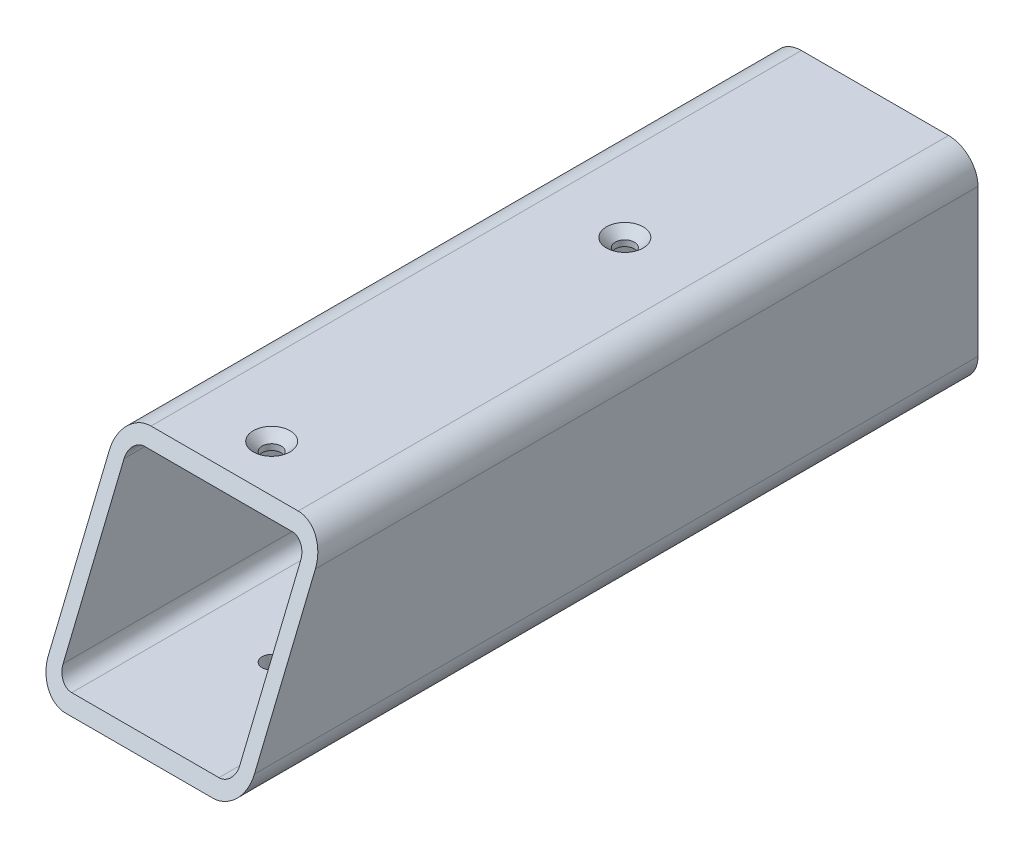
ISO-10303-21;
HEADER;
FILE_DESCRIPTION(('STEP AP214'),'2;1');
FILE_NAME('part.step','',(''),(''),'','','');
FILE_SCHEMA(('AUTOMOTIVE_DESIGN { 1 0 10303 214 1 1 1 1 }'));
ENDSEC;
DATA;
#1=APPLICATION_CONTEXT('core data for automotive mechanical design processes');
#2=APPLICATION_PROTOCOL_DEFINITION('international standard','automotive_design',2000,#1);
#3=PRODUCT_CONTEXT('',#1,'mechanical');
#4=PRODUCT('Part','Part','',(#3));
#5=PRODUCT_RELATED_PRODUCT_CATEGORY('part','',(#4));
#6=PRODUCT_DEFINITION_FORMATION('','',#4);
#7=PRODUCT_DEFINITION_CONTEXT('part definition',#1,'design');
#8=PRODUCT_DEFINITION('design','',#6,#7);
#9=PRODUCT_DEFINITION_SHAPE('','',#8);
#10=(LENGTH_UNIT() NAMED_UNIT(*) SI_UNIT(.MILLI.,.METRE.));
#11=(NAMED_UNIT(*) PLANE_ANGLE_UNIT() SI_UNIT($,.RADIAN.));
#12=(NAMED_UNIT(*) SI_UNIT($,.STERADIAN.) SOLID_ANGLE_UNIT());
#13=UNCERTAINTY_MEASURE_WITH_UNIT(LENGTH_MEASURE(1.E-05),#10,'distance_accuracy_value','');
#14=(GEOMETRIC_REPRESENTATION_CONTEXT(3) GLOBAL_UNCERTAINTY_ASSIGNED_CONTEXT((#13)) GLOBAL_UNIT_ASSIGNED_CONTEXT((#10,
#11,#12)) REPRESENTATION_CONTEXT('',''));
#15=CARTESIAN_POINT('',(0.,0.,0.));
#16=DIRECTION('',(0.,0.,1.));
#17=DIRECTION('',(1.,0.,0.));
#18=AXIS2_PLACEMENT_3D('',#15,#16,#17);
#19=CARTESIAN_POINT('',(-25.,-25.,0.));
#20=DIRECTION('',(0.,0.,-1.));
#21=DIRECTION('',(-1.,0.,0.));
#22=AXIS2_PLACEMENT_3D('',#19,#20,#21);
#23=PLANE('',#22);
#24=CARTESIAN_POINT('',(-25.,-25.,0.));
#25=DIRECTION('',(0.,0.,1.));
#26=DIRECTION('',(-1.,0.,0.));
#27=AXIS2_PLACEMENT_3D('',#24,#25,#26);
#28=CIRCLE('',#27,10.);
#29=CARTESIAN_POINT('',(-35.,-25.,0.));
#30=VERTEX_POINT('',#29);
#31=CARTESIAN_POINT('',(-25.,-35.,0.));
#32=VERTEX_POINT('',#31);
#33=EDGE_CURVE('E339',#30,#32,#28,.T.);
#34=ORIENTED_EDGE('',*,*,#33,.F.);
#35=DIRECTION('',(0.,-1.,0.));
#36=VECTOR('',#35,1.);
#37=CARTESIAN_POINT('',(-35.,25.,0.));
#38=LINE('',#37,#36);
#39=CARTESIAN_POINT('',(-35.,25.,0.));
#40=VERTEX_POINT('',#39);
#41=EDGE_CURVE('E158',#40,#30,#38,.T.);
#42=ORIENTED_EDGE('',*,*,#41,.F.);
#43=CARTESIAN_POINT('',(-25.,25.,0.));
#44=DIRECTION('',(0.,0.,1.));
#45=DIRECTION('',(1.,0.,0.));
#46=AXIS2_PLACEMENT_3D('',#43,#44,#45);
#47=CIRCLE('',#46,9.99999999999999);
#48=CARTESIAN_POINT('',(-25.,35.,0.));
#49=VERTEX_POINT('',#48);
#50=EDGE_CURVE('E355',#49,#40,#47,.T.);
#51=ORIENTED_EDGE('',*,*,#50,.F.);
#52=DIRECTION('',(-1.,0.,0.));
#53=VECTOR('',#52,1.);
#54=CARTESIAN_POINT('',(-25.,35.,0.));
#55=LINE('',#54,#53);
#56=CARTESIAN_POINT('',(25.,35.,0.));
#57=VERTEX_POINT('',#56);
#58=EDGE_CURVE('E352',#57,#49,#55,.T.);
#59=ORIENTED_EDGE('',*,*,#58,.F.);
#60=CARTESIAN_POINT('',(25.,25.,0.));
#61=DIRECTION('',(0.,0.,1.));
#62=DIRECTION('',(1.,0.,0.));
#63=AXIS2_PLACEMENT_3D('',#60,#61,#62);
#64=CIRCLE('',#63,10.);
#65=CARTESIAN_POINT('',(35.,25.,0.));
#66=VERTEX_POINT('',#65);
#67=EDGE_CURVE('E349',#66,#57,#64,.T.);
#68=ORIENTED_EDGE('',*,*,#67,.F.);
#69=DIRECTION('',(0.,1.,0.));
#70=VECTOR('',#69,1.);
#71=CARTESIAN_POINT('',(35.,25.,0.));
#72=LINE('',#71,#70);
#73=CARTESIAN_POINT('',(35.,-25.,0.));
#74=VERTEX_POINT('',#73);
#75=EDGE_CURVE('E346',#74,#66,#72,.T.);
#76=ORIENTED_EDGE('',*,*,#75,.F.);
#77=CARTESIAN_POINT('',(25.,-25.,0.));
#78=DIRECTION('',(0.,0.,1.));
#79=DIRECTION('',(-1.,0.,0.));
#80=AXIS2_PLACEMENT_3D('',#77,#78,#79);
#81=CIRCLE('',#80,10.);
#82=CARTESIAN_POINT('',(25.,-35.,0.));
#83=VERTEX_POINT('',#82);
#84=EDGE_CURVE('E344',#83,#74,#81,.T.);
#85=ORIENTED_EDGE('',*,*,#84,.F.);
#86=DIRECTION('',(1.,0.,0.));
#87=VECTOR('',#86,1.);
#88=CARTESIAN_POINT('',(-25.,-35.,0.));
#89=LINE('',#88,#87);
#90=EDGE_CURVE('E171',#32,#83,#89,.T.);
#91=ORIENTED_EDGE('',*,*,#90,.F.);
#92=EDGE_LOOP('',(#34,#42,#51,#59,#68,#76,#85,#91));
#93=FACE_BOUND('',#92,.T.);
#94=DIRECTION('',(-1.,0.,0.));
#95=VECTOR('',#94,1.);
#96=CARTESIAN_POINT('',(-25.,30.,0.));
#97=LINE('',#96,#95);
#98=CARTESIAN_POINT('',(25.,30.,0.));
#99=VERTEX_POINT('',#98);
#100=CARTESIAN_POINT('',(-25.,30.,0.));
#101=VERTEX_POINT('',#100);
#102=EDGE_CURVE('E286',#99,#101,#97,.T.);
#103=ORIENTED_EDGE('',*,*,#102,.T.);
#104=CARTESIAN_POINT('',(-25.,25.,0.));
#105=DIRECTION('',(0.,0.,1.));
#106=DIRECTION('',(1.,0.,0.));
#107=AXIS2_PLACEMENT_3D('',#104,#105,#106);
#108=CIRCLE('',#107,5.);
#109=CARTESIAN_POINT('',(-30.,25.,0.));
#110=VERTEX_POINT('',#109);
#111=EDGE_CURVE('E284',#101,#110,#108,.T.);
#112=ORIENTED_EDGE('',*,*,#111,.T.);
#113=DIRECTION('',(0.,-1.,0.));
#114=VECTOR('',#113,1.);
#115=CARTESIAN_POINT('',(-30.,25.,0.));
#116=LINE('',#115,#114);
#117=CARTESIAN_POINT('',(-30.,-25.,0.));
#118=VERTEX_POINT('',#117);
#119=EDGE_CURVE('E308',#110,#118,#116,.T.);
#120=ORIENTED_EDGE('',*,*,#119,.T.);
#121=CARTESIAN_POINT('',(-25.,-25.,0.));
#122=DIRECTION('',(0.,0.,1.));
#123=DIRECTION('',(-1.,0.,0.));
#124=AXIS2_PLACEMENT_3D('',#121,#122,#123);
#125=CIRCLE('',#124,5.);
#126=CARTESIAN_POINT('',(-25.,-30.,0.));
#127=VERTEX_POINT('',#126);
#128=EDGE_CURVE('E311',#118,#127,#125,.T.);
#129=ORIENTED_EDGE('',*,*,#128,.T.);
#130=DIRECTION('',(1.,0.,0.));
#131=VECTOR('',#130,1.);
#132=CARTESIAN_POINT('',(-25.,-30.,0.));
#133=LINE('',#132,#131);
#134=CARTESIAN_POINT('',(25.,-30.,0.));
#135=VERTEX_POINT('',#134);
#136=EDGE_CURVE('E314',#127,#135,#133,.T.);
#137=ORIENTED_EDGE('',*,*,#136,.T.);
#138=CARTESIAN_POINT('',(25.,-25.,0.));
#139=DIRECTION('',(0.,0.,1.));
#140=DIRECTION('',(-1.,0.,0.));
#141=AXIS2_PLACEMENT_3D('',#138,#139,#140);
#142=CIRCLE('',#141,4.99999999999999);
#143=CARTESIAN_POINT('',(30.,-25.,0.));
#144=VERTEX_POINT('',#143);
#145=EDGE_CURVE('E317',#135,#144,#142,.T.);
#146=ORIENTED_EDGE('',*,*,#145,.T.);
#147=DIRECTION('',(0.,1.,0.));
#148=VECTOR('',#147,1.);
#149=CARTESIAN_POINT('',(30.,25.,0.));
#150=LINE('',#149,#148);
#151=CARTESIAN_POINT('',(30.,25.,0.));
#152=VERTEX_POINT('',#151);
#153=EDGE_CURVE('E320',#144,#152,#150,.T.);
#154=ORIENTED_EDGE('',*,*,#153,.T.);
#155=CARTESIAN_POINT('',(25.,25.,0.));
#156=DIRECTION('',(0.,0.,1.));
#157=DIRECTION('',(1.,0.,0.));
#158=AXIS2_PLACEMENT_3D('',#155,#156,#157);
#159=CIRCLE('',#158,5.);
#160=EDGE_CURVE('E323',#152,#99,#159,.T.);
#161=ORIENTED_EDGE('',*,*,#160,.T.);
#162=EDGE_LOOP('',(#103,#112,#120,#129,#137,#146,#154,#161));
#163=FACE_BOUND('',#162,.T.);
#164=ADVANCED_FACE('F34',(#93,#163),#23,.T.);
#165=CARTESIAN_POINT('',(-25.,-25.,250.));
#166=DIRECTION('',(0.,0.,-1.));
#167=DIRECTION('',(-1.,0.,0.));
#168=AXIS2_PLACEMENT_3D('',#165,#166,#167);
#169=CYLINDRICAL_SURFACE('',#168,10.);
#170=DIRECTION('',(0.,0.,-1.));
#171=VECTOR('',#170,1.);
#172=CARTESIAN_POINT('',(-25.,-35.,250.));
#173=LINE('',#172,#171);
#174=CARTESIAN_POINT('',(-25.,-35.,250.));
#175=VERTEX_POINT('',#174);
#176=EDGE_CURVE('E172',#175,#32,#173,.T.);
#177=ORIENTED_EDGE('',*,*,#176,.F.);
#178=CARTESIAN_POINT('',(-25.,-25.,245.857864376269));
#179=DIRECTION('',(0.,-0.382683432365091,-0.923879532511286));
#180=DIRECTION('',(0.,0.923879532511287,-0.382683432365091));
#181=AXIS2_PLACEMENT_3D('',#178,#179,#180);
#182=ELLIPSE('',#181,10.8239220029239,10.);
#183=CARTESIAN_POINT('',(-35.,-25.,245.857864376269));
#184=VERTEX_POINT('',#183);
#185=EDGE_CURVE('E152',#175,#184,#182,.T.);
#186=ORIENTED_EDGE('',*,*,#185,.T.);
#187=DIRECTION('',(0.,0.,-1.));
#188=VECTOR('',#187,1.);
#189=CARTESIAN_POINT('',(-35.,-25.,250.));
#190=LINE('',#189,#188);
#191=EDGE_CURVE('E157',#184,#30,#190,.T.);
#192=ORIENTED_EDGE('',*,*,#191,.T.);
#193=ORIENTED_EDGE('',*,*,#33,.T.);
#194=EDGE_LOOP('',(#177,#186,#192,#193));
#195=FACE_BOUND('',#194,.T.);
#196=ADVANCED_FACE('F213',(#195),#169,.T.);
#197=CARTESIAN_POINT('',(-25.,-35.,250.));
#198=DIRECTION('',(0.,1.,0.));
#199=DIRECTION('',(-1.,0.,0.));
#200=AXIS2_PLACEMENT_3D('',#197,#198,#199);
#201=PLANE('',#200);
#202=CARTESIAN_POINT('',(0.,-35.,205.));
#203=DIRECTION('',(0.,1.,0.));
#204=DIRECTION('',(-1.,0.,0.));
#205=AXIS2_PLACEMENT_3D('',#202,#203,#204);
#206=CIRCLE('',#205,3.25);
#207=CARTESIAN_POINT('',(-3.25,-35.,205.));
#208=VERTEX_POINT('',#207);
#209=EDGE_CURVE('E196',#208,#208,#206,.F.);
#210=ORIENTED_EDGE('',*,*,#209,.F.);
#211=EDGE_LOOP('',(#210));
#212=FACE_BOUND('',#211,.T.);
#213=CARTESIAN_POINT('',(0.,-35.,85.));
#214=DIRECTION('',(0.,1.,0.));
#215=DIRECTION('',(-1.,0.,0.));
#216=AXIS2_PLACEMENT_3D('',#213,#214,#215);
#217=CIRCLE('',#216,3.25);
#218=CARTESIAN_POINT('',(-3.25,-35.,85.));
#219=VERTEX_POINT('',#218);
#220=EDGE_CURVE('E187',#219,#219,#217,.F.);
#221=ORIENTED_EDGE('',*,*,#220,.F.);
#222=EDGE_LOOP('',(#221));
#223=FACE_BOUND('',#222,.T.);
#224=ORIENTED_EDGE('',*,*,#90,.T.);
#225=DIRECTION('',(0.,0.,-1.));
#226=VECTOR('',#225,1.);
#227=CARTESIAN_POINT('',(25.,-35.,250.));
#228=LINE('',#227,#226);
#229=CARTESIAN_POINT('',(25.,-35.,250.));
#230=VERTEX_POINT('',#229);
#231=EDGE_CURVE('E165',#230,#83,#228,.T.);
#232=ORIENTED_EDGE('',*,*,#231,.F.);
#233=DIRECTION('',(1.,0.,0.));
#234=VECTOR('',#233,1.);
#235=CARTESIAN_POINT('',(-25.,-35.,250.));
#236=LINE('',#235,#234);
#237=EDGE_CURVE('E146',#175,#230,#236,.T.);
#238=ORIENTED_EDGE('',*,*,#237,.F.);
#239=ORIENTED_EDGE('',*,*,#176,.T.);
#240=EDGE_LOOP('',(#224,#232,#238,#239));
#241=FACE_BOUND('',#240,.T.);
#242=ADVANCED_FACE('F170',(#212,#223,#241),#201,.F.);
#243=CARTESIAN_POINT('',(25.,-25.,250.));
#244=DIRECTION('',(0.,0.,-1.));
#245=DIRECTION('',(-1.,0.,0.));
#246=AXIS2_PLACEMENT_3D('',#243,#244,#245);
#247=CYLINDRICAL_SURFACE('',#246,10.);
#248=DIRECTION('',(0.,0.,-1.));
#249=VECTOR('',#248,1.);
#250=CARTESIAN_POINT('',(35.,-25.,250.));
#251=LINE('',#250,#249);
#252=CARTESIAN_POINT('',(35.,-25.,245.857864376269));
#253=VERTEX_POINT('',#252);
#254=EDGE_CURVE('E167',#253,#74,#251,.T.);
#255=ORIENTED_EDGE('',*,*,#254,.F.);
#256=CARTESIAN_POINT('',(25.,-25.,245.857864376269));
#257=DIRECTION('',(0.,-0.382683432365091,-0.923879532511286));
#258=DIRECTION('',(0.,0.923879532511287,-0.382683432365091));
#259=AXIS2_PLACEMENT_3D('',#256,#257,#258);
#260=ELLIPSE('',#259,10.8239220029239,10.);
#261=EDGE_CURVE('E149',#253,#230,#260,.T.);
#262=ORIENTED_EDGE('',*,*,#261,.T.);
#263=ORIENTED_EDGE('',*,*,#231,.T.);
#264=ORIENTED_EDGE('',*,*,#84,.T.);
#265=EDGE_LOOP('',(#255,#262,#263,#264));
#266=FACE_BOUND('',#265,.T.);
#267=ADVANCED_FACE('F163',(#266),#247,.T.);
#268=CARTESIAN_POINT('',(35.,25.,250.));
#269=DIRECTION('',(-1.,0.,0.));
#270=DIRECTION('',(0.,-1.,0.));
#271=AXIS2_PLACEMENT_3D('',#268,#269,#270);
#272=PLANE('',#271);
#273=DIRECTION('',(0.,0.,-1.));
#274=VECTOR('',#273,1.);
#275=CARTESIAN_POINT('',(35.,25.,250.));
#276=LINE('',#275,#274);
#277=CARTESIAN_POINT('',(35.,25.,225.147186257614));
#278=VERTEX_POINT('',#277);
#279=EDGE_CURVE('E176',#278,#66,#276,.T.);
#280=ORIENTED_EDGE('',*,*,#279,.F.);
#281=DIRECTION('',(0.,-0.923879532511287,0.382683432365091));
#282=VECTOR('',#281,1.);
#283=CARTESIAN_POINT('',(35.,16.2132034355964,228.786796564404));
#284=LINE('',#283,#282);
#285=EDGE_CURVE('E168',#278,#253,#284,.T.);
#286=ORIENTED_EDGE('',*,*,#285,.T.);
#287=ORIENTED_EDGE('',*,*,#254,.T.);
#288=ORIENTED_EDGE('',*,*,#75,.T.);
#289=EDGE_LOOP('',(#280,#286,#287,#288));
#290=FACE_BOUND('',#289,.T.);
#291=ADVANCED_FACE('F242',(#290),#272,.F.);
#292=CARTESIAN_POINT('',(25.,25.,250.));
#293=DIRECTION('',(0.,0.,-1.));
#294=DIRECTION('',(-1.,0.,0.));
#295=AXIS2_PLACEMENT_3D('',#292,#293,#294);
#296=CYLINDRICAL_SURFACE('',#295,10.);
#297=DIRECTION('',(0.,0.,-1.));
#298=VECTOR('',#297,1.);
#299=CARTESIAN_POINT('',(25.,35.,250.));
#300=LINE('',#299,#298);
#301=CARTESIAN_POINT('',(25.,35.,221.005050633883));
#302=VERTEX_POINT('',#301);
#303=EDGE_CURVE('E365',#302,#57,#300,.T.);
#304=ORIENTED_EDGE('',*,*,#303,.F.);
#305=CARTESIAN_POINT('',(25.,25.,225.147186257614));
#306=DIRECTION('',(0.,-0.382683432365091,-0.923879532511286));
#307=DIRECTION('',(0.,0.923879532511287,-0.382683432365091));
#308=AXIS2_PLACEMENT_3D('',#305,#306,#307);
#309=ELLIPSE('',#308,10.8239220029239,10.);
#310=EDGE_CURVE('E302',#302,#278,#309,.T.);
#311=ORIENTED_EDGE('',*,*,#310,.T.);
#312=ORIENTED_EDGE('',*,*,#279,.T.);
#313=ORIENTED_EDGE('',*,*,#67,.T.);
#314=EDGE_LOOP('',(#304,#311,#312,#313));
#315=FACE_BOUND('',#314,.T.);
#316=ADVANCED_FACE('F238',(#315),#296,.T.);
#317=CARTESIAN_POINT('',(-25.,35.,250.));
#318=DIRECTION('',(0.,-1.,0.));
#319=DIRECTION('',(0.,0.,-1.));
#320=AXIS2_PLACEMENT_3D('',#317,#318,#319);
#321=PLANE('',#320);
#322=CARTESIAN_POINT('',(0.,35.,205.));
#323=DIRECTION('',(0.,-1.,0.));
#324=DIRECTION('',(0.,0.,-1.));
#325=AXIS2_PLACEMENT_3D('',#322,#323,#324);
#326=CIRCLE('',#325,6.24999999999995);
#327=CARTESIAN_POINT('',(0.,35.,198.75));
#328=VERTEX_POINT('',#327);
#329=EDGE_CURVE('E11',#328,#328,#326,.T.);
#330=ORIENTED_EDGE('',*,*,#329,.T.);
#331=EDGE_LOOP('',(#330));
#332=FACE_BOUND('',#331,.T.);
#333=CARTESIAN_POINT('',(0.,35.,85.));
#334=DIRECTION('',(0.,-1.,0.));
#335=DIRECTION('',(0.,0.,-1.));
#336=AXIS2_PLACEMENT_3D('',#333,#334,#335);
#337=CIRCLE('',#336,6.24999999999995);
#338=CARTESIAN_POINT('',(0.,35.,78.7500000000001));
#339=VERTEX_POINT('',#338);
#340=EDGE_CURVE('E190',#339,#339,#337,.T.);
#341=ORIENTED_EDGE('',*,*,#340,.T.);
#342=EDGE_LOOP('',(#341));
#343=FACE_BOUND('',#342,.T.);
#344=DIRECTION('',(0.,0.,-1.));
#345=VECTOR('',#344,1.);
#346=CARTESIAN_POINT('',(-25.,35.,250.));
#347=LINE('',#346,#345);
#348=CARTESIAN_POINT('',(-25.,35.,221.005050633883));
#349=VERTEX_POINT('',#348);
#350=EDGE_CURVE('E363',#349,#49,#347,.T.);
#351=ORIENTED_EDGE('',*,*,#350,.F.);
#352=DIRECTION('',(1.,0.,0.));
#353=VECTOR('',#352,1.);
#354=CARTESIAN_POINT('',(-25.,35.,221.005050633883));
#355=LINE('',#354,#353);
#356=EDGE_CURVE('E299',#349,#302,#355,.T.);
#357=ORIENTED_EDGE('',*,*,#356,.T.);
#358=ORIENTED_EDGE('',*,*,#303,.T.);
#359=ORIENTED_EDGE('',*,*,#58,.T.);
#360=EDGE_LOOP('',(#351,#357,#358,#359));
#361=FACE_BOUND('',#360,.T.);
#362=ADVANCED_FACE('F234',(#332,#343,#361),#321,.F.);
#363=CARTESIAN_POINT('',(-25.,25.,250.));
#364=DIRECTION('',(0.,0.,-1.));
#365=DIRECTION('',(-1.,0.,0.));
#366=AXIS2_PLACEMENT_3D('',#363,#364,#365);
#367=CYLINDRICAL_SURFACE('',#366,9.99999999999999);
#368=DIRECTION('',(0.,0.,-1.));
#369=VECTOR('',#368,1.);
#370=CARTESIAN_POINT('',(-35.,25.,250.));
#371=LINE('',#370,#369);
#372=CARTESIAN_POINT('',(-35.,25.,225.147186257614));
#373=VERTEX_POINT('',#372);
#374=EDGE_CURVE('E361',#373,#40,#371,.T.);
#375=ORIENTED_EDGE('',*,*,#374,.F.);
#376=CARTESIAN_POINT('',(-25.,25.,225.147186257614));
#377=DIRECTION('',(0.,-0.382683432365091,-0.923879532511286));
#378=DIRECTION('',(0.,0.923879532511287,-0.382683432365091));
#379=AXIS2_PLACEMENT_3D('',#376,#377,#378);
#380=ELLIPSE('',#379,10.8239220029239,9.99999999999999);
#381=EDGE_CURVE('E49',#373,#349,#380,.T.);
#382=ORIENTED_EDGE('',*,*,#381,.T.);
#383=ORIENTED_EDGE('',*,*,#350,.T.);
#384=ORIENTED_EDGE('',*,*,#50,.T.);
#385=EDGE_LOOP('',(#375,#382,#383,#384));
#386=FACE_BOUND('',#385,.T.);
#387=ADVANCED_FACE('F230',(#386),#367,.T.);
#388=CARTESIAN_POINT('',(-35.,25.,250.));
#389=DIRECTION('',(1.,0.,0.));
#390=DIRECTION('',(0.,1.,0.));
#391=AXIS2_PLACEMENT_3D('',#388,#389,#390);
#392=PLANE('',#391);
#393=ORIENTED_EDGE('',*,*,#191,.F.);
#394=DIRECTION('',(0.,0.923879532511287,-0.382683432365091));
#395=VECTOR('',#394,1.);
#396=CARTESIAN_POINT('',(-35.,16.2132034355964,228.786796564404));
#397=LINE('',#396,#395);
#398=EDGE_CURVE('E291',#184,#373,#397,.T.);
#399=ORIENTED_EDGE('',*,*,#398,.T.);
#400=ORIENTED_EDGE('',*,*,#374,.T.);
#401=ORIENTED_EDGE('',*,*,#41,.T.);
#402=EDGE_LOOP('',(#393,#399,#400,#401));
#403=FACE_BOUND('',#402,.T.);
#404=ADVANCED_FACE('F227',(#403),#392,.F.);
#405=CARTESIAN_POINT('',(-25.,25.,250.));
#406=DIRECTION('',(0.,0.,-1.));
#407=DIRECTION('',(-1.,0.,0.));
#408=AXIS2_PLACEMENT_3D('',#405,#406,#407);
#409=CYLINDRICAL_SURFACE('',#408,5.);
#410=CARTESIAN_POINT('',(-25.,25.,225.147186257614));
#411=DIRECTION('',(0.,-0.382683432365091,-0.923879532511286));
#412=DIRECTION('',(0.,0.923879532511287,-0.382683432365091));
#413=AXIS2_PLACEMENT_3D('',#410,#411,#412);
#414=ELLIPSE('',#413,5.41196100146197,5.);
#415=CARTESIAN_POINT('',(-30.,25.,225.147186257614));
#416=VERTEX_POINT('',#415);
#417=CARTESIAN_POINT('',(-25.,30.,223.076118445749));
#418=VERTEX_POINT('',#417);
#419=EDGE_CURVE('E57',#416,#418,#414,.T.);
#420=ORIENTED_EDGE('',*,*,#419,.F.);
#421=DIRECTION('',(0.,0.,-1.));
#422=VECTOR('',#421,1.);
#423=CARTESIAN_POINT('',(-30.,25.,250.));
#424=LINE('',#423,#422);
#425=EDGE_CURVE('E338',#416,#110,#424,.T.);
#426=ORIENTED_EDGE('',*,*,#425,.T.);
#427=ORIENTED_EDGE('',*,*,#111,.F.);
#428=DIRECTION('',(0.,0.,-1.));
#429=VECTOR('',#428,1.);
#430=CARTESIAN_POINT('',(-25.,30.,250.));
#431=LINE('',#430,#429);
#432=EDGE_CURVE('E277',#418,#101,#431,.T.);
#433=ORIENTED_EDGE('',*,*,#432,.F.);
#434=EDGE_LOOP('',(#420,#426,#427,#433));
#435=FACE_BOUND('',#434,.T.);
#436=ADVANCED_FACE('F225',(#435),#409,.F.);
#437=CARTESIAN_POINT('',(-30.,25.,250.));
#438=DIRECTION('',(1.,0.,0.));
#439=DIRECTION('',(0.,1.,0.));
#440=AXIS2_PLACEMENT_3D('',#437,#438,#439);
#441=PLANE('',#440);
#442=DIRECTION('',(0.,0.923879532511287,-0.382683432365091));
#443=VECTOR('',#442,1.);
#444=CARTESIAN_POINT('',(-30.,16.2132034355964,228.786796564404));
#445=LINE('',#444,#443);
#446=CARTESIAN_POINT('',(-30.,-25.,245.857864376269));
#447=VERTEX_POINT('',#446);
#448=EDGE_CURVE('E290',#447,#416,#445,.T.);
#449=ORIENTED_EDGE('',*,*,#448,.F.);
#450=DIRECTION('',(0.,0.,-1.));
#451=VECTOR('',#450,1.);
#452=CARTESIAN_POINT('',(-30.,-25.,250.));
#453=LINE('',#452,#451);
#454=EDGE_CURVE('E336',#447,#118,#453,.T.);
#455=ORIENTED_EDGE('',*,*,#454,.T.);
#456=ORIENTED_EDGE('',*,*,#119,.F.);
#457=ORIENTED_EDGE('',*,*,#425,.F.);
#458=EDGE_LOOP('',(#449,#455,#456,#457));
#459=FACE_BOUND('',#458,.T.);
#460=ADVANCED_FACE('F379',(#459),#441,.T.);
#461=CARTESIAN_POINT('',(-25.,-25.,250.));
#462=DIRECTION('',(0.,0.,-1.));
#463=DIRECTION('',(-1.,0.,0.));
#464=AXIS2_PLACEMENT_3D('',#461,#462,#463);
#465=CYLINDRICAL_SURFACE('',#464,5.);
#466=CARTESIAN_POINT('',(-25.,-25.,245.857864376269));
#467=DIRECTION('',(0.,-0.382683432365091,-0.923879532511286));
#468=DIRECTION('',(0.,0.923879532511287,-0.382683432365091));
#469=AXIS2_PLACEMENT_3D('',#466,#467,#468);
#470=ELLIPSE('',#469,5.41196100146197,5.);
#471=CARTESIAN_POINT('',(-25.,-30.,247.928932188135));
#472=VERTEX_POINT('',#471);
#473=EDGE_CURVE('E294',#472,#447,#470,.T.);
#474=ORIENTED_EDGE('',*,*,#473,.F.);
#475=DIRECTION('',(0.,0.,-1.));
#476=VECTOR('',#475,1.);
#477=CARTESIAN_POINT('',(-25.,-30.,250.));
#478=LINE('',#477,#476);
#479=EDGE_CURVE('E334',#472,#127,#478,.T.);
#480=ORIENTED_EDGE('',*,*,#479,.T.);
#481=ORIENTED_EDGE('',*,*,#128,.F.);
#482=ORIENTED_EDGE('',*,*,#454,.F.);
#483=EDGE_LOOP('',(#474,#480,#481,#482));
#484=FACE_BOUND('',#483,.T.);
#485=ADVANCED_FACE('F402',(#484),#465,.F.);
#486=CARTESIAN_POINT('',(-25.,-30.,250.));
#487=DIRECTION('',(0.,1.,0.));
#488=DIRECTION('',(-1.,0.,0.));
#489=AXIS2_PLACEMENT_3D('',#486,#487,#488);
#490=PLANE('',#489);
#491=CARTESIAN_POINT('',(0.,-30.,205.));
#492=DIRECTION('',(0.,1.,0.));
#493=DIRECTION('',(-1.,0.,0.));
#494=AXIS2_PLACEMENT_3D('',#491,#492,#493);
#495=CIRCLE('',#494,3.25);
#496=CARTESIAN_POINT('',(-3.25,-30.,205.));
#497=VERTEX_POINT('',#496);
#498=EDGE_CURVE('E195',#497,#497,#495,.T.);
#499=ORIENTED_EDGE('',*,*,#498,.F.);
#500=EDGE_LOOP('',(#499));
#501=FACE_BOUND('',#500,.T.);
#502=CARTESIAN_POINT('',(0.,-30.,85.));
#503=DIRECTION('',(0.,1.,0.));
#504=DIRECTION('',(-1.,0.,0.));
#505=AXIS2_PLACEMENT_3D('',#502,#503,#504);
#506=CIRCLE('',#505,3.25);
#507=CARTESIAN_POINT('',(-3.25,-30.,85.));
#508=VERTEX_POINT('',#507);
#509=EDGE_CURVE('E186',#508,#508,#506,.T.);
#510=ORIENTED_EDGE('',*,*,#509,.F.);
#511=EDGE_LOOP('',(#510));
#512=FACE_BOUND('',#511,.T.);
#513=DIRECTION('',(-1.,0.,0.));
#514=VECTOR('',#513,1.);
#515=CARTESIAN_POINT('',(-25.,-30.,247.928932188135));
#516=LINE('',#515,#514);
#517=CARTESIAN_POINT('',(25.,-30.,247.928932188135));
#518=VERTEX_POINT('',#517);
#519=EDGE_CURVE('E398',#518,#472,#516,.T.);
#520=ORIENTED_EDGE('',*,*,#519,.F.);
#521=DIRECTION('',(0.,0.,-1.));
#522=VECTOR('',#521,1.);
#523=CARTESIAN_POINT('',(25.,-30.,250.));
#524=LINE('',#523,#522);
#525=EDGE_CURVE('E332',#518,#135,#524,.T.);
#526=ORIENTED_EDGE('',*,*,#525,.T.);
#527=ORIENTED_EDGE('',*,*,#136,.F.);
#528=ORIENTED_EDGE('',*,*,#479,.F.);
#529=EDGE_LOOP('',(#520,#526,#527,#528));
#530=FACE_BOUND('',#529,.T.);
#531=ADVANCED_FACE('F405',(#501,#512,#530),#490,.T.);
#532=CARTESIAN_POINT('',(25.,-25.,250.));
#533=DIRECTION('',(0.,0.,-1.));
#534=DIRECTION('',(-1.,0.,0.));
#535=AXIS2_PLACEMENT_3D('',#532,#533,#534);
#536=CYLINDRICAL_SURFACE('',#535,4.99999999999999);
#537=CARTESIAN_POINT('',(25.,-25.,245.857864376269));
#538=DIRECTION('',(0.,-0.382683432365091,-0.923879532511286));
#539=DIRECTION('',(0.,0.923879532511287,-0.382683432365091));
#540=AXIS2_PLACEMENT_3D('',#537,#538,#539);
#541=ELLIPSE('',#540,5.41196100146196,4.99999999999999);
#542=CARTESIAN_POINT('',(30.,-25.,245.857864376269));
#543=VERTEX_POINT('',#542);
#544=EDGE_CURVE('E390',#543,#518,#541,.T.);
#545=ORIENTED_EDGE('',*,*,#544,.F.);
#546=DIRECTION('',(0.,0.,-1.));
#547=VECTOR('',#546,1.);
#548=CARTESIAN_POINT('',(30.,-25.,250.));
#549=LINE('',#548,#547);
#550=EDGE_CURVE('E330',#543,#144,#549,.T.);
#551=ORIENTED_EDGE('',*,*,#550,.T.);
#552=ORIENTED_EDGE('',*,*,#145,.F.);
#553=ORIENTED_EDGE('',*,*,#525,.F.);
#554=EDGE_LOOP('',(#545,#551,#552,#553));
#555=FACE_BOUND('',#554,.T.);
#556=ADVANCED_FACE('F409',(#555),#536,.F.);
#557=CARTESIAN_POINT('',(30.,25.,250.));
#558=DIRECTION('',(-1.,0.,0.));
#559=DIRECTION('',(0.,-1.,0.));
#560=AXIS2_PLACEMENT_3D('',#557,#558,#559);
#561=PLANE('',#560);
#562=DIRECTION('',(0.,-0.923879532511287,0.382683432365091));
#563=VECTOR('',#562,1.);
#564=CARTESIAN_POINT('',(30.,16.2132034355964,228.786796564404));
#565=LINE('',#564,#563);
#566=CARTESIAN_POINT('',(30.,25.,225.147186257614));
#567=VERTEX_POINT('',#566);
#568=EDGE_CURVE('E388',#567,#543,#565,.T.);
#569=ORIENTED_EDGE('',*,*,#568,.F.);
#570=DIRECTION('',(0.,0.,-1.));
#571=VECTOR('',#570,1.);
#572=CARTESIAN_POINT('',(30.,25.,250.));
#573=LINE('',#572,#571);
#574=EDGE_CURVE('E328',#567,#152,#573,.T.);
#575=ORIENTED_EDGE('',*,*,#574,.T.);
#576=ORIENTED_EDGE('',*,*,#153,.F.);
#577=ORIENTED_EDGE('',*,*,#550,.F.);
#578=EDGE_LOOP('',(#569,#575,#576,#577));
#579=FACE_BOUND('',#578,.T.);
#580=ADVANCED_FACE('F412',(#579),#561,.T.);
#581=CARTESIAN_POINT('',(25.,25.,250.));
#582=DIRECTION('',(0.,0.,-1.));
#583=DIRECTION('',(-1.,0.,0.));
#584=AXIS2_PLACEMENT_3D('',#581,#582,#583);
#585=CYLINDRICAL_SURFACE('',#584,5.);
#586=CARTESIAN_POINT('',(25.,25.,225.147186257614));
#587=DIRECTION('',(0.,-0.382683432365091,-0.923879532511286));
#588=DIRECTION('',(0.,0.923879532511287,-0.382683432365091));
#589=AXIS2_PLACEMENT_3D('',#586,#587,#588);
#590=ELLIPSE('',#589,5.41196100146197,5.);
#591=CARTESIAN_POINT('',(25.,30.,223.076118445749));
#592=VERTEX_POINT('',#591);
#593=EDGE_CURVE('E386',#592,#567,#590,.T.);
#594=ORIENTED_EDGE('',*,*,#593,.F.);
#595=DIRECTION('',(0.,0.,-1.));
#596=VECTOR('',#595,1.);
#597=CARTESIAN_POINT('',(25.,30.,250.));
#598=LINE('',#597,#596);
#599=EDGE_CURVE('E279',#592,#99,#598,.T.);
#600=ORIENTED_EDGE('',*,*,#599,.T.);
#601=ORIENTED_EDGE('',*,*,#160,.F.);
#602=ORIENTED_EDGE('',*,*,#574,.F.);
#603=EDGE_LOOP('',(#594,#600,#601,#602));
#604=FACE_BOUND('',#603,.T.);
#605=ADVANCED_FACE('F273',(#604),#585,.F.);
#606=CARTESIAN_POINT('',(-25.,30.,250.));
#607=DIRECTION('',(0.,-1.,0.));
#608=DIRECTION('',(0.,0.,-1.));
#609=AXIS2_PLACEMENT_3D('',#606,#607,#608);
#610=PLANE('',#609);
#611=CARTESIAN_POINT('',(0.,30.,205.));
#612=DIRECTION('',(0.,-1.,0.));
#613=DIRECTION('',(0.,0.,-1.));
#614=AXIS2_PLACEMENT_3D('',#611,#612,#613);
#615=CIRCLE('',#614,3.25);
#616=CARTESIAN_POINT('',(0.,30.,201.75));
#617=VERTEX_POINT('',#616);
#618=EDGE_CURVE('E193',#617,#617,#615,.T.);
#619=ORIENTED_EDGE('',*,*,#618,.F.);
#620=EDGE_LOOP('',(#619));
#621=FACE_BOUND('',#620,.T.);
#622=CARTESIAN_POINT('',(0.,30.,85.));
#623=DIRECTION('',(0.,-1.,0.));
#624=DIRECTION('',(0.,0.,-1.));
#625=AXIS2_PLACEMENT_3D('',#622,#623,#624);
#626=CIRCLE('',#625,3.25);
#627=CARTESIAN_POINT('',(0.,30.,81.75));
#628=VERTEX_POINT('',#627);
#629=EDGE_CURVE('E183',#628,#628,#626,.T.);
#630=ORIENTED_EDGE('',*,*,#629,.F.);
#631=EDGE_LOOP('',(#630));
#632=FACE_BOUND('',#631,.T.);
#633=DIRECTION('',(1.,0.,0.));
#634=VECTOR('',#633,1.);
#635=CARTESIAN_POINT('',(-25.,30.,223.076118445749));
#636=LINE('',#635,#634);
#637=EDGE_CURVE('E174',#418,#592,#636,.T.);
#638=ORIENTED_EDGE('',*,*,#637,.F.);
#639=ORIENTED_EDGE('',*,*,#432,.T.);
#640=ORIENTED_EDGE('',*,*,#102,.F.);
#641=ORIENTED_EDGE('',*,*,#599,.F.);
#642=EDGE_LOOP('',(#638,#639,#640,#641));
#643=FACE_BOUND('',#642,.T.);
#644=ADVANCED_FACE('F270',(#621,#632,#643),#610,.T.);
#645=CARTESIAN_POINT('',(446.108241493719,-35.0000000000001,250.));
#646=DIRECTION('',(0.,-0.382683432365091,-0.923879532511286));
#647=DIRECTION('',(0.,0.923879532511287,-0.382683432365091));
#648=AXIS2_PLACEMENT_3D('',#645,#646,#647);
#649=PLANE('',#648);
#650=ORIENTED_EDGE('',*,*,#448,.T.);
#651=ORIENTED_EDGE('',*,*,#419,.T.);
#652=ORIENTED_EDGE('',*,*,#637,.T.);
#653=ORIENTED_EDGE('',*,*,#593,.T.);
#654=ORIENTED_EDGE('',*,*,#568,.T.);
#655=ORIENTED_EDGE('',*,*,#544,.T.);
#656=ORIENTED_EDGE('',*,*,#519,.T.);
#657=ORIENTED_EDGE('',*,*,#473,.T.);
#658=EDGE_LOOP('',(#650,#651,#652,#653,#654,#655,#656,#657));
#659=FACE_BOUND('',#658,.T.);
#660=ORIENTED_EDGE('',*,*,#185,.F.);
#661=ORIENTED_EDGE('',*,*,#237,.T.);
#662=ORIENTED_EDGE('',*,*,#261,.F.);
#663=ORIENTED_EDGE('',*,*,#285,.F.);
#664=ORIENTED_EDGE('',*,*,#310,.F.);
#665=ORIENTED_EDGE('',*,*,#356,.F.);
#666=ORIENTED_EDGE('',*,*,#381,.F.);
#667=ORIENTED_EDGE('',*,*,#398,.F.);
#668=EDGE_LOOP('',(#660,#661,#662,#663,#664,#665,#666,#667));
#669=FACE_BOUND('',#668,.T.);
#670=ADVANCED_FACE('F148',(#659,#669),#649,.F.);
#671=CARTESIAN_POINT('',(0.,-44.1923881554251,85.));
#672=DIRECTION('',(0.,1.,0.));
#673=DIRECTION('',(0.,0.,1.));
#674=AXIS2_PLACEMENT_3D('',#671,#672,#673);
#675=CYLINDRICAL_SURFACE('',#674,3.25);
#676=CARTESIAN_POINT('',(0.,32.0000000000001,85.));
#677=DIRECTION('',(0.,-1.,0.));
#678=DIRECTION('',(0.,0.,-1.));
#679=AXIS2_PLACEMENT_3D('',#676,#677,#678);
#680=CIRCLE('',#679,3.25);
#681=CARTESIAN_POINT('',(0.,32.0000000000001,81.75));
#682=VERTEX_POINT('',#681);
#683=EDGE_CURVE('E182',#682,#682,#680,.F.);
#684=ORIENTED_EDGE('',*,*,#683,.T.);
#685=EDGE_LOOP('',(#684));
#686=FACE_BOUND('',#685,.T.);
#687=ORIENTED_EDGE('',*,*,#629,.T.);
#688=EDGE_LOOP('',(#687));
#689=FACE_BOUND('',#688,.T.);
#690=ADVANCED_FACE('F259',(#686,#689),#675,.F.);
#691=ORIENTED_EDGE('',*,*,#509,.T.);
#692=EDGE_LOOP('',(#691));
#693=FACE_BOUND('',#692,.T.);
#694=ORIENTED_EDGE('',*,*,#220,.T.);
#695=EDGE_LOOP('',(#694));
#696=FACE_BOUND('',#695,.T.);
#697=ADVANCED_FACE('F253',(#693,#696),#675,.F.);
#698=CARTESIAN_POINT('',(0.,32.0000000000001,85.));
#699=DIRECTION('',(0.,1.,0.));
#700=DIRECTION('',(0.,0.,1.));
#701=AXIS2_PLACEMENT_3D('',#698,#699,#700);
#702=CONICAL_SURFACE('',#701,3.25,0.785398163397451);
#703=ORIENTED_EDGE('',*,*,#340,.F.);
#704=EDGE_LOOP('',(#703));
#705=FACE_BOUND('',#704,.T.);
#706=ORIENTED_EDGE('',*,*,#683,.F.);
#707=EDGE_LOOP('',(#706));
#708=FACE_BOUND('',#707,.T.);
#709=ADVANCED_FACE('F251',(#705,#708),#702,.F.);
#710=CARTESIAN_POINT('',(0.,-44.1923881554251,205.));
#711=DIRECTION('',(0.,1.,0.));
#712=DIRECTION('',(0.,0.,1.));
#713=AXIS2_PLACEMENT_3D('',#710,#711,#712);
#714=CYLINDRICAL_SURFACE('',#713,3.25);
#715=CARTESIAN_POINT('',(0.,32.0000000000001,205.));
#716=DIRECTION('',(0.,-1.,0.));
#717=DIRECTION('',(0.,0.,-1.));
#718=AXIS2_PLACEMENT_3D('',#715,#716,#717);
#719=CIRCLE('',#718,3.25);
#720=CARTESIAN_POINT('',(0.,32.0000000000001,201.75));
#721=VERTEX_POINT('',#720);
#722=EDGE_CURVE('E42',#721,#721,#719,.F.);
#723=ORIENTED_EDGE('',*,*,#722,.T.);
#724=EDGE_LOOP('',(#723));
#725=FACE_BOUND('',#724,.T.);
#726=ORIENTED_EDGE('',*,*,#618,.T.);
#727=EDGE_LOOP('',(#726));
#728=FACE_BOUND('',#727,.T.);
#729=ADVANCED_FACE('F200',(#725,#728),#714,.F.);
#730=ORIENTED_EDGE('',*,*,#498,.T.);
#731=EDGE_LOOP('',(#730));
#732=FACE_BOUND('',#731,.T.);
#733=ORIENTED_EDGE('',*,*,#209,.T.);
#734=EDGE_LOOP('',(#733));
#735=FACE_BOUND('',#734,.T.);
#736=ADVANCED_FACE('F204',(#732,#735),#714,.F.);
#737=CARTESIAN_POINT('',(0.,32.0000000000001,205.));
#738=DIRECTION('',(0.,1.,0.));
#739=DIRECTION('',(0.,0.,1.));
#740=AXIS2_PLACEMENT_3D('',#737,#738,#739);
#741=CONICAL_SURFACE('',#740,3.25,0.785398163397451);
#742=ORIENTED_EDGE('',*,*,#329,.F.);
#743=EDGE_LOOP('',(#742));
#744=FACE_BOUND('',#743,.T.);
#745=ORIENTED_EDGE('',*,*,#722,.F.);
#746=EDGE_LOOP('',(#745));
#747=FACE_BOUND('',#746,.T.);
#748=ADVANCED_FACE('F36',(#744,#747),#741,.F.);
#749=CLOSED_SHELL('',(#164,#196,#242,#267,#291,#316,#362,#387,#404,#436,#460,#485,#531,#556,
#580,#605,#644,#670,#690,#697,#709,#729,#736,#748));
#750=MANIFOLD_SOLID_BREP('B2',#749);
#751=ADVANCED_BREP_SHAPE_REPRESENTATION('',(#18,#750),#14);
#752=SHAPE_DEFINITION_REPRESENTATION(#9,#751);
ENDSEC;
END-ISO-10303-21;
